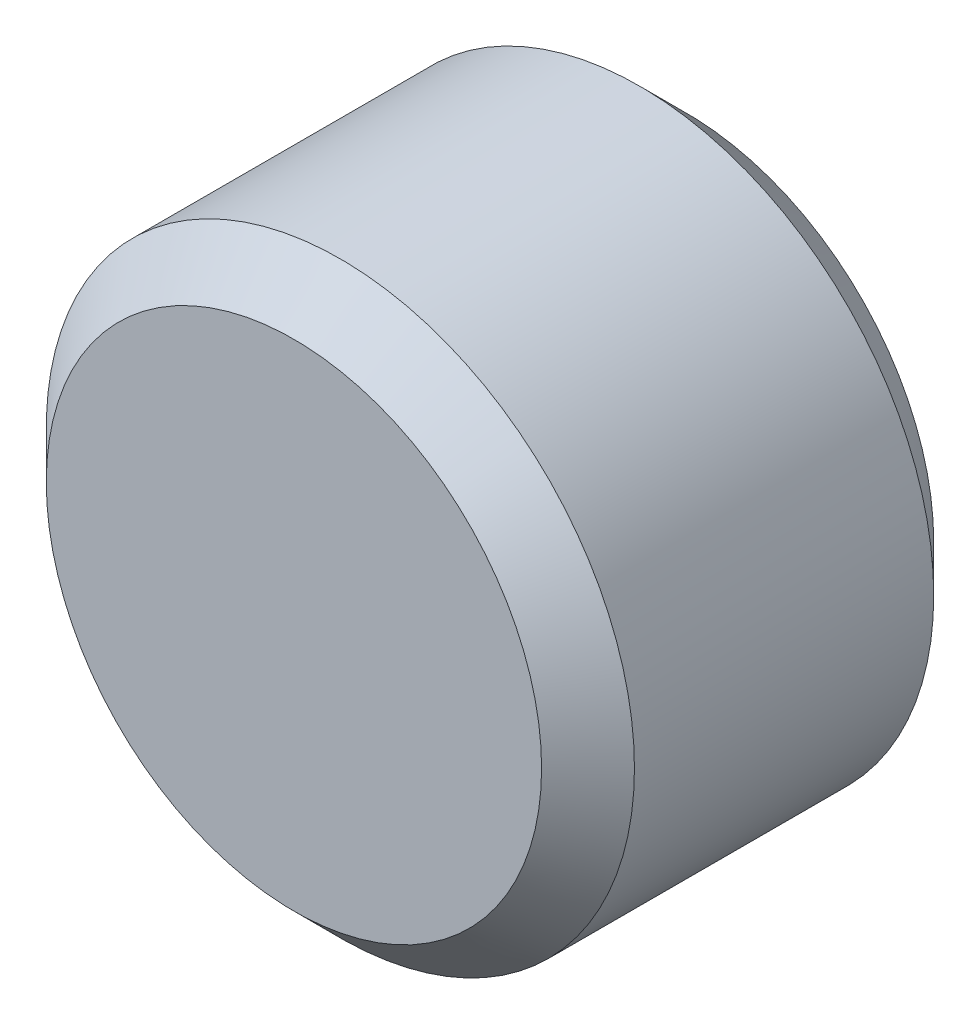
from build123d import *

# Parameters (mm, degrees)
SKETCH1_R          = 6
BASE_EXTRUDE_DEPTH = 8
CHAMFER1_SIZE      = 0.9471875
HOLE1_D            = 6
HOLE1_DEPTH        = 4.8
HOLE1_TIP          = 1.732050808
CUT_EXTRUDE1_DEPTH = 4.8


with BuildPart() as part:
    # Sketch1 → Base-Extrude (new body)
    with BuildSketch(Plane.XY):
        Circle(SKETCH1_R)
    extrude(amount=BASE_EXTRUDE_DEPTH)

    # Chamfer1
    chamfer1_edges = [part.edges().sort_by_distance(p)[0] for p in [
        (-6, 0, 0),
        (-6, 0, 8),
    ]]
    chamfer(chamfer1_edges, length=CHAMFER1_SIZE)

    # Hole1
    with Locations(Plane(origin=(0, 0, 0), x_dir=(-1, 0, 0), z_dir=(0, 0, -1))):
        with Locations((0, 0)):
            Hole(HOLE1_D / 2, depth=HOLE1_DEPTH)
            with Locations((0, 0, -(HOLE1_DEPTH + HOLE1_TIP / 2))):  # 120° drill point
                Cone(0, HOLE1_D / 2, HOLE1_TIP, mode=Mode.SUBTRACT)

    # Sketch4 → Cut-Extrude1 (cut)
    with BuildSketch(Plane(origin=(0, 0, 0), x_dir=(-1, 0, 0), z_dir=(0, 0, -1))):
        Polygon((-1.732050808, 3), (1.732050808, 3), (3.464101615, 0), (1.732050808, -3), (-1.732050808, -3), (-3.464101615, 0), align=None)
    extrude(amount=-CUT_EXTRUDE1_DEPTH, mode=Mode.SUBTRACT)


solid = part.part
